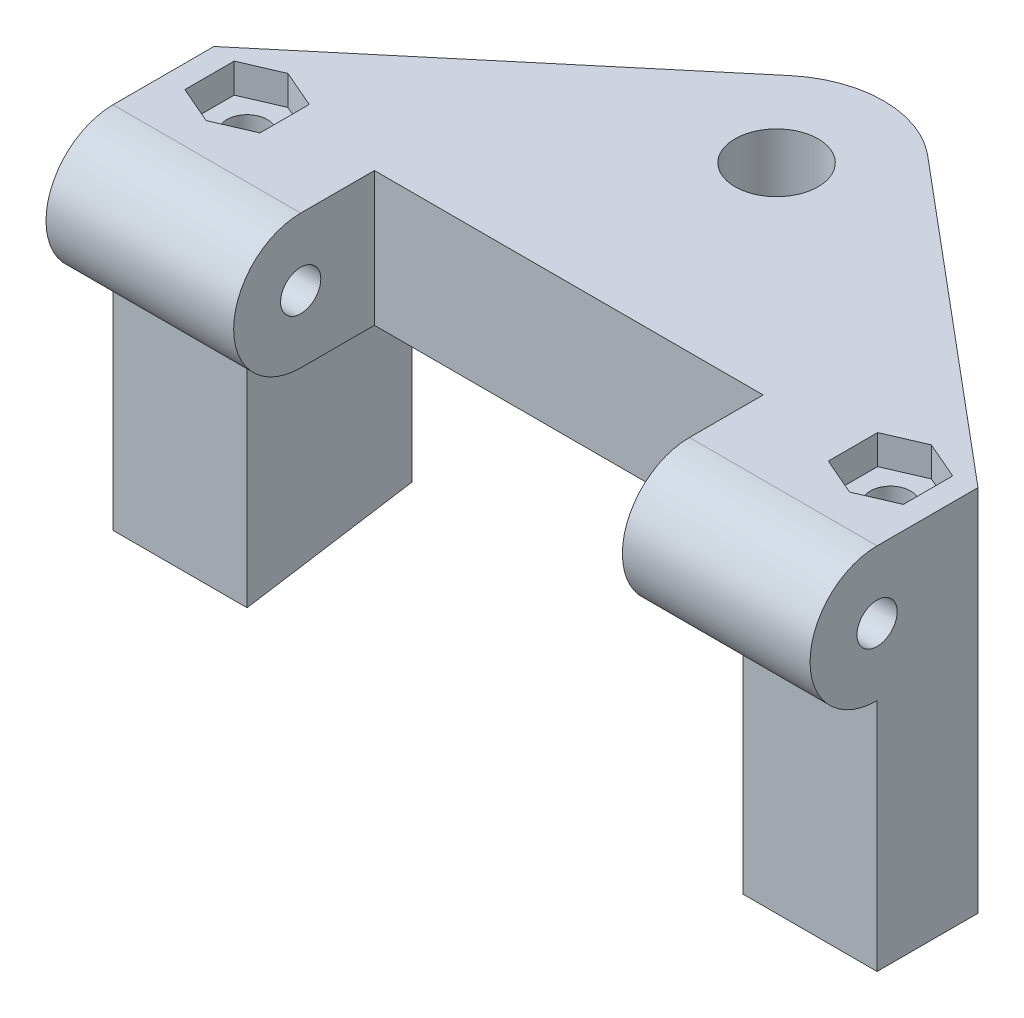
from build123d import *

# Parameters (mm, degrees)
SKETCH_1_W           = 57
SKETCH_1_H           = 55
SKETCH_1_W_2         = 37
SKETCH_1_H_2         = 35
EXTRUDE_1_DEPTH      = 9
SKETCH_4_R           = 5
SKETCH_4_R_2         = 1.5
EXTRUDE_2_DEPTH      = 14
SKETCH_2_W           = 10
SKETCH_2_H           = 5.5
EXTRUDE_3_DEPTH      = 35
CUT_EXTRUDE_4_DEPTH  = 30
EXTRUDE_4_DEPTH      = 10
CUT_EXTRUDE_8_DEPTH  = 46.512230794
CUT_EXTRUDE_9_DEPTH  = 17.5
SKETCH_8_R           = 1.5
CUT_EXTRUDE_10_DEPTH = 46.512230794
SKETCH_8_3_R         = 1.5
CUT_EXTRUDE_11_DEPTH = 2.2


with BuildPart() as part:
    # Sketch 1 → Extrude 1 (new body)
    with BuildSketch(Plane.XY):
        with Locations((2.075531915, -11.959574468)):
            Rectangle(SKETCH_1_W, SKETCH_1_H)
        with Locations((2.075531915, -11.959574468)):
            Rectangle(SKETCH_1_W_2, SKETCH_1_H_2, mode=Mode.SUBTRACT)
    extrude(amount=EXTRUDE_1_DEPTH)

    # Sketch 4 → Extrude 2 (add)
    # profile 1 of 4: a face of its own
    with BuildSketch(Plane.ZY.offset(26.424468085)):
        with BuildLine():
            Line((9, 15.540425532), (9, 5.540425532))
            Line((9, 5.540425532), (14.500000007, 5.540425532))
            ThreePointArc((14.500000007, 5.540425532), (9.5, 10.540425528), (14.5, 15.540425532))
            Line((14.5, 15.540425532), (9, 15.540425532))
        make_face()
    # profile 2 of 4: a face of its own
    with BuildSketch(Plane.ZY.offset(26.424468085)):
        with Locations((14.5, 10.540425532)):
            Circle(SKETCH_4_R)
        with Locations(Location((14.5, 10.540425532, 0), (0, 0, 270))):
            Circle(SKETCH_4_R_2, mode=Mode.SUBTRACT)
    # profile 3 of 4: a face of its own
    with BuildSketch(Plane.ZY.offset(26.424468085)):
        with Locations((14.5, -34.459574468)):
            Circle(SKETCH_4_R)
        with Locations(Location((14.5, -34.459574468, 0), (0, 0, 270))):
            Circle(SKETCH_4_R_2, mode=Mode.SUBTRACT)
    # profile 4 of 4: a face of its own
    with BuildSketch(Plane.ZY.offset(26.424468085)):
        with BuildLine():
            Line((14.5, -29.459574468), (9, -29.459574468))
            Line((9, -29.459574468), (9, -39.459574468))
            Line((9, -39.459574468), (14.5, -39.459574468))
            ThreePointArc((14.5, -39.459574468), (9.5, -34.459574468), (14.5, -29.459574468))
        make_face()
    extrude_2 = extrude(amount=-EXTRUDE_2_DEPTH)

    # Mirror 1: Extrude 2 across plane
    add(extrude_2.mirror(Plane.ZY.offset(-2.075531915)))

    # Sketch 2 → Extrude 3 (add)
    with BuildSketch(Plane(origin=(0, -29.459574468, 0), x_dir=(1, 0, 0), z_dir=(0, 1, 0))):
        with Locations((-21.424468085, -11.75)):
            Rectangle(SKETCH_2_W, SKETCH_2_H)
        with Locations((25.575531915, -11.75)):
            Rectangle(SKETCH_2_W, SKETCH_2_H)
    extrude(amount=EXTRUDE_3_DEPTH)

    # Sketch 3 → Cut-Extrude 4 (cut)
    with BuildSketch(Plane(origin=(0, -11.959574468, 0), x_dir=(-1, 0, 0), z_dir=(0, -1, 0))):
        Polygon((26.424468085, 0), (-30.575531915, 0), (-30.575531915, -14.5), (-16.575531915, -14.5), (-16.575531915, -9), (12.424468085, -9), (12.424468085, -14.5), (26.424468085, -14.5), align=None)
    extrude(amount=CUT_EXTRUDE_4_DEPTH, mode=Mode.SUBTRACT)


with BuildPart() as body_2:
    # of the pieces the cut leaves, the one that is kept (cut_extrude_4_keep)
    add(part.part.solids().sort_by_distance((-26.424468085, 15.540425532, 0))[0])

    # Sketch 6 → Extrude 4 (add)
    with BuildSketch(Plane(origin=(0, 15.540425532, 0), x_dir=(1, 0, 0), z_dir=(0, 1, 0))):
        with BuildLine():
            ThreePointArc((-2.588157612, 0), (-5.680091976, 4.53778236), (-5.11821537, 10))
            Line((-5.11821537, 10), (-6.199121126, 10))
            Line((-6.199121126, 10), (-18.116657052, 0))
            Line((-18.116657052, 0), (-2.588157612, 0))
        make_face()
        with BuildLine():
            ThreePointArc((-5.11821537, 10), (-4.230939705, 11.42223686), (-3.066768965, 12.628355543))
            Line((-3.066768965, 12.628355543), (-6.199121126, 10))
            Line((-6.199121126, 10), (-5.11821537, 10))
        make_face()
        with BuildLine():
            ThreePointArc((7.217832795, 12.628355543), (4.811693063, 14.017540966), (2.075531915, 14.5))
            Line((2.075531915, 14.5), (2.075531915, 10))
            Line((2.075531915, 10), (9.2692792, 10))
            ThreePointArc((9.2692792, 10), (8.382003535, 11.42223686), (7.217832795, 12.628355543))
        make_face()
        with BuildLine():
            Line((2.075531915, 10), (2.075531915, 14.5))
            ThreePointArc((2.075531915, 14.5), (-0.660629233, 14.017540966), (-3.066768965, 12.628355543))
            ThreePointArc((-3.066768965, 12.628355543), (-4.230939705, 11.42223686), (-5.11821537, 10))
            Line((-5.11821537, 10), (2.075531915, 10))
        make_face()
        with BuildLine():
            Line((9.2692792, 10), (2.075531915, 10))
            Line((2.075531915, 10), (2.075531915, 9.6))
            ThreePointArc((2.075531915, 9.6), (4.267562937, 8.692031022), (5.175531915, 6.5))
            ThreePointArc((5.175531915, 6.5), (4.267562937, 4.307968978), (2.075531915, 3.4))
            Line((2.075531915, 3.4), (2.075531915, 0))
            Line((2.075531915, 0), (6.739221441, 0))
            ThreePointArc((6.739221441, 0), (9.19274753, 2.846886), (10.075531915, 6.5))
            ThreePointArc((10.075531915, 6.5), (9.871363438, 8.295831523), (9.2692792, 10))
        make_face()
        with BuildLine():
            Line((2.075531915, 9.6), (2.075531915, 10))
            Line((2.075531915, 10), (-5.11821537, 10))
            ThreePointArc((-5.11821537, 10), (-5.680091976, 4.53778236), (-2.588157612, 0))
            Line((-2.588157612, 0), (2.075531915, 0))
            Line((2.075531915, 0), (2.075531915, 3.4))
            ThreePointArc((2.075531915, 3.4), (-1.024468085, 6.5), (2.075531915, 9.6))
        make_face()
        with BuildLine():
            Line((9.2692792, 10), (2.075531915, 10))
            Line((2.075531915, 10), (2.075531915, 9.6))
            ThreePointArc((2.075531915, 9.6), (4.267562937, 8.692031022), (5.175531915, 6.5))
            ThreePointArc((5.175531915, 6.5), (4.267562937, 4.307968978), (2.075531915, 3.4))
            Line((2.075531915, 3.4), (2.075531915, 0))
            Line((2.075531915, 0), (6.739221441, 0))
            ThreePointArc((6.739221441, 0), (9.19274753, 2.846886), (10.075531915, 6.5))
            ThreePointArc((10.075531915, 6.5), (9.871363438, 8.295831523), (9.2692792, 10))
        make_face()
        with BuildLine():
            Line((2.075531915, 9.6), (2.075531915, 10))
            Line((2.075531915, 10), (-5.11821537, 10))
            ThreePointArc((-5.11821537, 10), (-5.680091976, 4.53778236), (-2.588157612, 0))
            Line((-2.588157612, 0), (2.075531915, 0))
            Line((2.075531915, 0), (2.075531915, 3.4))
            ThreePointArc((2.075531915, 3.4), (-1.024468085, 6.5), (2.075531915, 9.6))
        make_face()
        with BuildLine():
            ThreePointArc((7.217832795, 12.628355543), (4.811693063, 14.017540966), (2.075531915, 14.5))
            Line((2.075531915, 14.5), (2.075531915, 10))
            Line((2.075531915, 10), (9.2692792, 10))
            ThreePointArc((9.2692792, 10), (8.382003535, 11.42223686), (7.217832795, 12.628355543))
        make_face()
        with BuildLine():
            Line((2.075531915, 10), (2.075531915, 14.5))
            ThreePointArc((2.075531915, 14.5), (-0.660629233, 14.017540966), (-3.066768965, 12.628355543))
            ThreePointArc((-3.066768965, 12.628355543), (-4.230939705, 11.42223686), (-5.11821537, 10))
            Line((-5.11821537, 10), (2.075531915, 10))
        make_face()
        with BuildLine():
            Line((10.350184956, 10), (7.217832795, 12.628355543))
            ThreePointArc((7.217832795, 12.628355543), (8.382003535, 11.42223686), (9.2692792, 10))
            Line((9.2692792, 10), (10.350184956, 10))
        make_face()
        with BuildLine():
            Line((10.350184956, 10), (9.2692792, 10))
            ThreePointArc((9.2692792, 10), (9.871363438, 8.295831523), (10.075531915, 6.5))
            ThreePointArc((10.075531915, 6.5), (9.19274753, 2.846886), (6.739221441, 0))
            Line((6.739221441, 0), (22.267720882, 0))
            Line((22.267720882, 0), (10.350184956, 10))
        make_face()
    extrude(amount=-EXTRUDE_4_DEPTH)

    # Sketch 6_3 → Cut-Extrude 8 (cut, through all)
    with BuildSketch(Plane(origin=(0, 15.540425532, 0), x_dir=(1, 0, 0), z_dir=(0, 1, 0))):
        Polygon((30.575531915, 0), (22.267720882, 0), (30.575531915, -6.971081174), align=None)
        Polygon((-18.116657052, 0), (-26.424468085, 0), (-26.424468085, -6.971081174), align=None)
    extrude(amount=-CUT_EXTRUDE_8_DEPTH, mode=Mode.SUBTRACT)

    # Sketch 7 → Cut-Extrude 9 (cut)
    with BuildSketch(Plane.XZ.offset(11.959574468)):
        Polygon((22.543602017, 0.231491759), (20.575531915, 14.5), (20.575531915, 0), (22.267720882, 0), align=None)
        Polygon((-16.424468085, 14.5), (-18.392538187, 0.231491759), (-18.116657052, 0), (-16.424468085, 0), align=None)
    extrude(amount=-CUT_EXTRUDE_9_DEPTH, mode=Mode.SUBTRACT)

    # Sketch 8 → Cut-Extrude 10 (cut, through all)
    with BuildSketch(Plane(origin=(0, 15.540425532, 0), x_dir=(1, 0, 0), z_dir=(0, 1, 0))):
        with Locations(Location((-21.924468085, -9, 0), (0, 0, 180))):
            Circle(SKETCH_8_R)
    cut_extrude_10 = extrude(amount=-CUT_EXTRUDE_10_DEPTH, mode=Mode.SUBTRACT)

    # Sketch 8_3 → Cut-Extrude 11 (cut)
    with BuildSketch(Plane(origin=(0, 15.540425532, 0), x_dir=(1, 0, 0), z_dir=(0, 1, 0))):
        Polygon((-24.724468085, -7.159338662), (-21.924468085, -5.95), (-19.124468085, -7.159338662), (-19.124468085, -10.840661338), (-21.924468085, -12.05), (-24.724468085, -10.840661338), align=None)
        with Locations(Location((-21.924468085, -9, 0), (0, 0, 180))):
            Circle(SKETCH_8_3_R, mode=Mode.SUBTRACT)
    cut_extrude_11 = extrude(amount=-CUT_EXTRUDE_11_DEPTH, mode=Mode.SUBTRACT)

    # Mirror 3: Cut-Extrude 10, Cut-Extrude 11 across plane
    add(cut_extrude_10.mirror(Plane.ZY.offset(-2.075531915)), mode=Mode.SUBTRACT)
    add(cut_extrude_11.mirror(Plane.ZY.offset(-2.075531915)), mode=Mode.SUBTRACT)


solid = body_2.part
